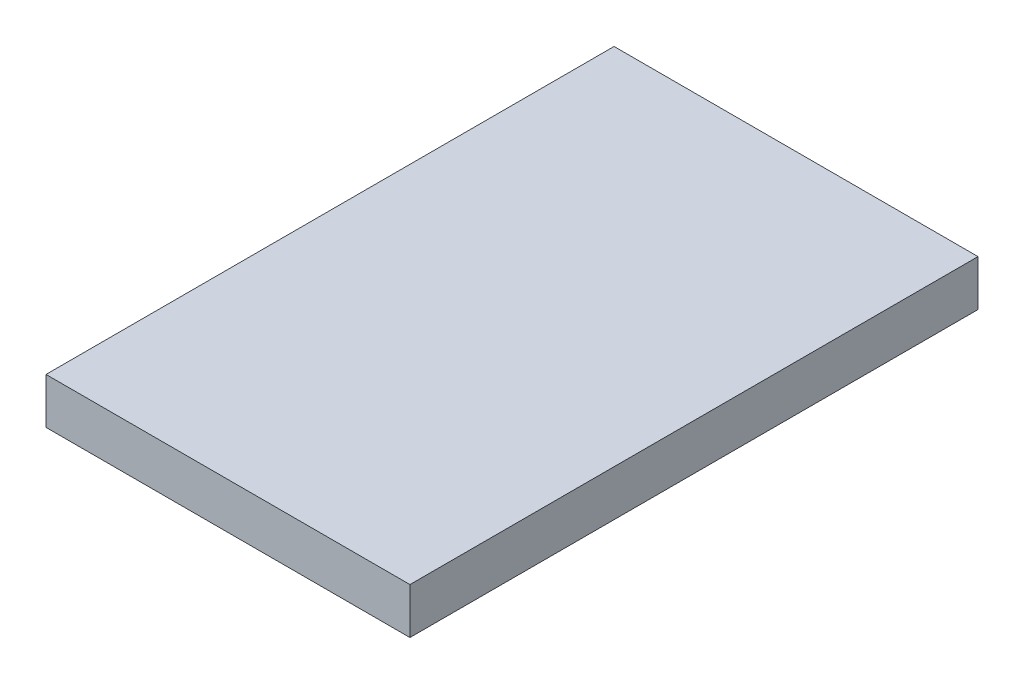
from build123d import *

# Parameters (mm, degrees)
SKETCH1_W      = 89.7677568
SKETCH1_H      = 140.116754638
EXTRUDE1_DEPTH = 11.318988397


with BuildPart() as part:
    # Sketch1 → Extrude1 (new body)
    with BuildSketch(Plane(origin=(0, 0, 0), x_dir=(1, 0, 0), z_dir=(0, 1, 0))):
        Rectangle(SKETCH1_W, SKETCH1_H)
    extrude(amount=EXTRUDE1_DEPTH)


solid = part.part
